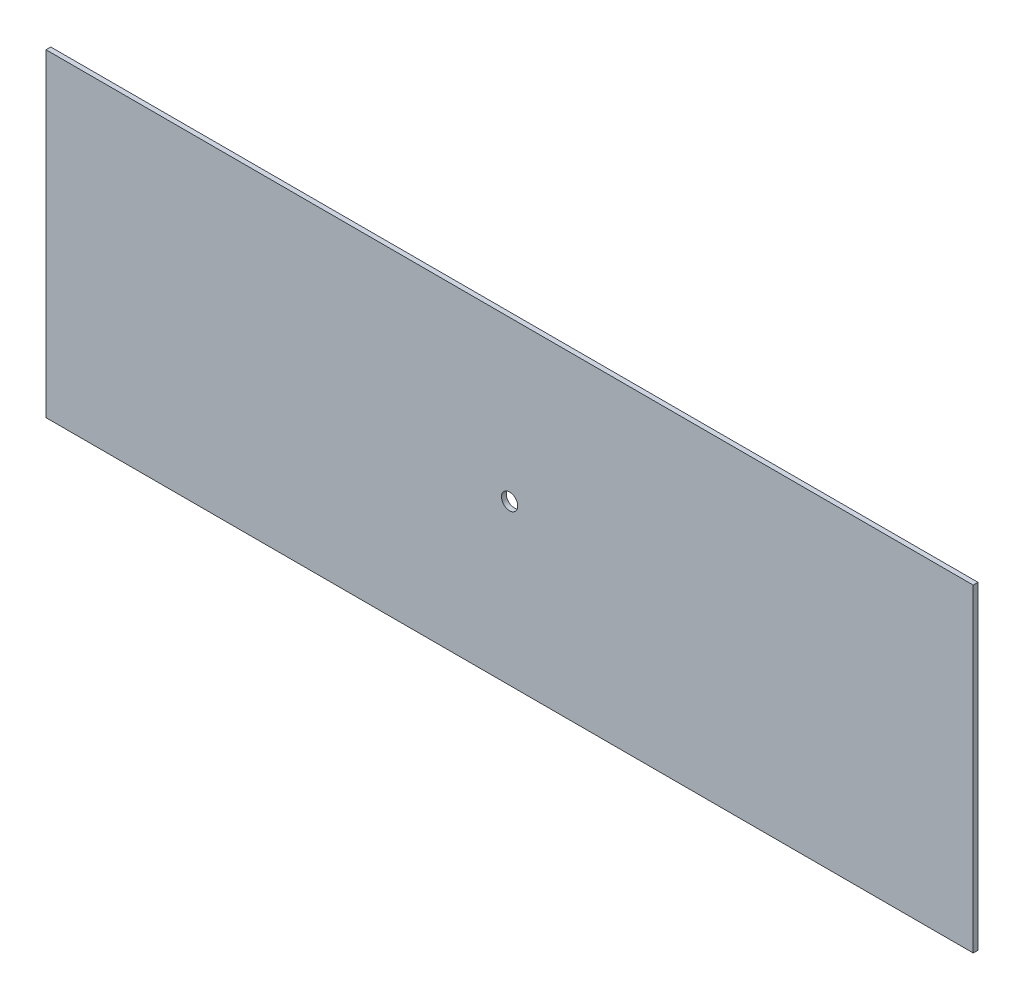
ISO-10303-21;
HEADER;
FILE_DESCRIPTION(('STEP AP214'),'2;1');
FILE_NAME('part.step','',(''),(''),'','','');
FILE_SCHEMA(('AUTOMOTIVE_DESIGN { 1 0 10303 214 1 1 1 1 }'));
ENDSEC;
DATA;
#1=APPLICATION_CONTEXT('core data for automotive mechanical design processes');
#2=APPLICATION_PROTOCOL_DEFINITION('international standard','automotive_design',2000,#1);
#3=PRODUCT_CONTEXT('',#1,'mechanical');
#4=PRODUCT('Part','Part','',(#3));
#5=PRODUCT_RELATED_PRODUCT_CATEGORY('part','',(#4));
#6=PRODUCT_DEFINITION_FORMATION('','',#4);
#7=PRODUCT_DEFINITION_CONTEXT('part definition',#1,'design');
#8=PRODUCT_DEFINITION('design','',#6,#7);
#9=PRODUCT_DEFINITION_SHAPE('','',#8);
#10=(LENGTH_UNIT() NAMED_UNIT(*) SI_UNIT(.MILLI.,.METRE.));
#11=(NAMED_UNIT(*) PLANE_ANGLE_UNIT() SI_UNIT($,.RADIAN.));
#12=(NAMED_UNIT(*) SI_UNIT($,.STERADIAN.) SOLID_ANGLE_UNIT());
#13=UNCERTAINTY_MEASURE_WITH_UNIT(LENGTH_MEASURE(1.E-05),#10,'distance_accuracy_value','');
#14=(GEOMETRIC_REPRESENTATION_CONTEXT(3) GLOBAL_UNCERTAINTY_ASSIGNED_CONTEXT((#13)) GLOBAL_UNIT_ASSIGNED_CONTEXT((#10,
#11,#12)) REPRESENTATION_CONTEXT('',''));
#15=CARTESIAN_POINT('',(0.,0.,0.));
#16=DIRECTION('',(0.,0.,1.));
#17=DIRECTION('',(1.,0.,0.));
#18=AXIS2_PLACEMENT_3D('',#15,#16,#17);
#19=CARTESIAN_POINT('',(457.2,-78.5622,-78.5622));
#20=DIRECTION('',(0.,1.,0.));
#21=DIRECTION('',(0.,0.,1.));
#22=AXIS2_PLACEMENT_3D('',#19,#20,#21);
#23=PLANE('',#22);
#24=DIRECTION('',(0.,0.,-1.));
#25=VECTOR('',#24,1.);
#26=CARTESIAN_POINT('',(0.,-78.5622,-78.5622));
#27=LINE('',#26,#25);
#28=CARTESIAN_POINT('',(0.,-78.5622,-76.2));
#29=VERTEX_POINT('',#28);
#30=CARTESIAN_POINT('',(0.,-78.5622,-78.5622));
#31=VERTEX_POINT('',#30);
#32=EDGE_CURVE('E116',#29,#31,#27,.T.);
#33=ORIENTED_EDGE('',*,*,#32,.T.);
#34=DIRECTION('',(-1.,0.,0.));
#35=VECTOR('',#34,1.);
#36=CARTESIAN_POINT('',(457.2,-78.5622,-78.5622));
#37=LINE('',#36,#35);
#38=CARTESIAN_POINT('',(457.2,-78.5622,-78.5622));
#39=VERTEX_POINT('',#38);
#40=EDGE_CURVE('E11',#39,#31,#37,.T.);
#41=ORIENTED_EDGE('',*,*,#40,.F.);
#42=DIRECTION('',(0.,0.,-1.));
#43=VECTOR('',#42,1.);
#44=CARTESIAN_POINT('',(457.2,-78.5622,-78.5622));
#45=LINE('',#44,#43);
#46=CARTESIAN_POINT('',(457.2,-78.5622,-76.2));
#47=VERTEX_POINT('',#46);
#48=EDGE_CURVE('E103',#47,#39,#45,.T.);
#49=ORIENTED_EDGE('',*,*,#48,.F.);
#50=DIRECTION('',(-1.,0.,0.));
#51=VECTOR('',#50,1.);
#52=CARTESIAN_POINT('',(457.2,-78.5622,-76.2));
#53=LINE('',#52,#51);
#54=EDGE_CURVE('E118',#47,#29,#53,.T.);
#55=ORIENTED_EDGE('',*,*,#54,.T.);
#56=EDGE_LOOP('',(#33,#41,#49,#55));
#57=FACE_BOUND('',#56,.T.);
#58=ADVANCED_FACE('F47',(#57),#23,.F.);
#59=CARTESIAN_POINT('',(457.2,-78.5622,-78.5622));
#60=DIRECTION('',(0.,0.,1.));
#61=DIRECTION('',(1.,0.,0.));
#62=AXIS2_PLACEMENT_3D('',#59,#60,#61);
#63=PLANE('',#62);
#64=CARTESIAN_POINT('',(228.6,0.,-78.5622));
#65=DIRECTION('',(0.,0.,1.));
#66=DIRECTION('',(1.,0.,0.));
#67=AXIS2_PLACEMENT_3D('',#64,#65,#66);
#68=CIRCLE('',#67,4.);
#69=CARTESIAN_POINT('',(232.6,0.,-78.5622));
#70=VERTEX_POINT('',#69);
#71=EDGE_CURVE('E138',#70,#70,#68,.T.);
#72=ORIENTED_EDGE('',*,*,#71,.T.);
#73=EDGE_LOOP('',(#72));
#74=FACE_BOUND('',#73,.T.);
#75=DIRECTION('',(0.,1.,0.));
#76=VECTOR('',#75,1.);
#77=CARTESIAN_POINT('',(0.,-78.5622,-78.5622));
#78=LINE('',#77,#76);
#79=CARTESIAN_POINT('',(0.,78.5622,-78.5622));
#80=VERTEX_POINT('',#79);
#81=EDGE_CURVE('E107',#31,#80,#78,.T.);
#82=ORIENTED_EDGE('',*,*,#81,.T.);
#83=DIRECTION('',(-1.,0.,0.));
#84=VECTOR('',#83,1.);
#85=CARTESIAN_POINT('',(457.2,78.5622,-78.5622));
#86=LINE('',#85,#84);
#87=CARTESIAN_POINT('',(457.2,78.5622,-78.5622));
#88=VERTEX_POINT('',#87);
#89=EDGE_CURVE('E58',#88,#80,#86,.T.);
#90=ORIENTED_EDGE('',*,*,#89,.F.);
#91=DIRECTION('',(0.,1.,0.));
#92=VECTOR('',#91,1.);
#93=CARTESIAN_POINT('',(457.2,-78.5622,-78.5622));
#94=LINE('',#93,#92);
#95=EDGE_CURVE('E98',#39,#88,#94,.T.);
#96=ORIENTED_EDGE('',*,*,#95,.F.);
#97=ORIENTED_EDGE('',*,*,#40,.T.);
#98=EDGE_LOOP('',(#82,#90,#96,#97));
#99=FACE_BOUND('',#98,.T.);
#100=ADVANCED_FACE('F110',(#74,#99),#63,.F.);
#101=CARTESIAN_POINT('',(457.2,78.5622,-78.5622));
#102=DIRECTION('',(0.,-1.,0.));
#103=DIRECTION('',(0.,0.,-1.));
#104=AXIS2_PLACEMENT_3D('',#101,#102,#103);
#105=PLANE('',#104);
#106=DIRECTION('',(0.,0.,1.));
#107=VECTOR('',#106,1.);
#108=CARTESIAN_POINT('',(0.,78.5622,-78.5622));
#109=LINE('',#108,#107);
#110=CARTESIAN_POINT('',(0.,78.5622,-76.2));
#111=VERTEX_POINT('',#110);
#112=EDGE_CURVE('E83',#80,#111,#109,.T.);
#113=ORIENTED_EDGE('',*,*,#112,.T.);
#114=DIRECTION('',(-1.,0.,0.));
#115=VECTOR('',#114,1.);
#116=CARTESIAN_POINT('',(457.2,78.5622,-76.2));
#117=LINE('',#116,#115);
#118=CARTESIAN_POINT('',(457.2,78.5622,-76.2));
#119=VERTEX_POINT('',#118);
#120=EDGE_CURVE('E109',#119,#111,#117,.T.);
#121=ORIENTED_EDGE('',*,*,#120,.F.);
#122=DIRECTION('',(0.,0.,1.));
#123=VECTOR('',#122,1.);
#124=CARTESIAN_POINT('',(457.2,78.5622,-78.5622));
#125=LINE('',#124,#123);
#126=EDGE_CURVE('E101',#88,#119,#125,.T.);
#127=ORIENTED_EDGE('',*,*,#126,.F.);
#128=ORIENTED_EDGE('',*,*,#89,.T.);
#129=EDGE_LOOP('',(#113,#121,#127,#128));
#130=FACE_BOUND('',#129,.T.);
#131=ADVANCED_FACE('F115',(#130),#105,.F.);
#132=CARTESIAN_POINT('',(457.2,-78.5622,-76.2));
#133=DIRECTION('',(0.,0.,-1.));
#134=DIRECTION('',(-1.,0.,0.));
#135=AXIS2_PLACEMENT_3D('',#132,#133,#134);
#136=PLANE('',#135);
#137=CARTESIAN_POINT('',(228.6,0.,-76.2));
#138=DIRECTION('',(0.,0.,-1.));
#139=DIRECTION('',(-1.,0.,0.));
#140=AXIS2_PLACEMENT_3D('',#137,#138,#139);
#141=CIRCLE('',#140,4.);
#142=CARTESIAN_POINT('',(224.6,0.,-76.2));
#143=VERTEX_POINT('',#142);
#144=EDGE_CURVE('E52',#143,#143,#141,.T.);
#145=ORIENTED_EDGE('',*,*,#144,.T.);
#146=EDGE_LOOP('',(#145));
#147=FACE_BOUND('',#146,.T.);
#148=DIRECTION('',(0.,-1.,0.));
#149=VECTOR('',#148,1.);
#150=CARTESIAN_POINT('',(0.,-78.5622,-76.2));
#151=LINE('',#150,#149);
#152=EDGE_CURVE('E93',#111,#29,#151,.T.);
#153=ORIENTED_EDGE('',*,*,#152,.T.);
#154=ORIENTED_EDGE('',*,*,#54,.F.);
#155=DIRECTION('',(0.,-1.,0.));
#156=VECTOR('',#155,1.);
#157=CARTESIAN_POINT('',(457.2,-78.5622,-76.2));
#158=LINE('',#157,#156);
#159=EDGE_CURVE('E70',#119,#47,#158,.T.);
#160=ORIENTED_EDGE('',*,*,#159,.F.);
#161=ORIENTED_EDGE('',*,*,#120,.T.);
#162=EDGE_LOOP('',(#153,#154,#160,#161));
#163=FACE_BOUND('',#162,.T.);
#164=ADVANCED_FACE('F132',(#147,#163),#136,.F.);
#165=CARTESIAN_POINT('',(457.2,0.,0.));
#166=DIRECTION('',(-1.,0.,0.));
#167=DIRECTION('',(0.,0.,1.));
#168=AXIS2_PLACEMENT_3D('',#165,#166,#167);
#169=PLANE('',#168);
#170=ORIENTED_EDGE('',*,*,#48,.T.);
#171=ORIENTED_EDGE('',*,*,#95,.T.);
#172=ORIENTED_EDGE('',*,*,#126,.T.);
#173=ORIENTED_EDGE('',*,*,#159,.T.);
#174=EDGE_LOOP('',(#170,#171,#172,#173));
#175=FACE_BOUND('',#174,.T.);
#176=ADVANCED_FACE('F97',(#175),#169,.F.);
#177=CARTESIAN_POINT('',(0.,0.,0.));
#178=DIRECTION('',(-1.,0.,0.));
#179=DIRECTION('',(0.,0.,1.));
#180=AXIS2_PLACEMENT_3D('',#177,#178,#179);
#181=PLANE('',#180);
#182=ORIENTED_EDGE('',*,*,#32,.F.);
#183=ORIENTED_EDGE('',*,*,#152,.F.);
#184=ORIENTED_EDGE('',*,*,#112,.F.);
#185=ORIENTED_EDGE('',*,*,#81,.F.);
#186=EDGE_LOOP('',(#182,#183,#184,#185));
#187=FACE_BOUND('',#186,.T.);
#188=ADVANCED_FACE('F137',(#187),#181,.T.);
#189=CARTESIAN_POINT('',(228.6,0.,-78.5622));
#190=DIRECTION('',(0.,0.,1.));
#191=DIRECTION('',(1.,0.,0.));
#192=AXIS2_PLACEMENT_3D('',#189,#190,#191);
#193=CYLINDRICAL_SURFACE('',#192,4.);
#194=ORIENTED_EDGE('',*,*,#71,.F.);
#195=EDGE_LOOP('',(#194));
#196=FACE_BOUND('',#195,.T.);
#197=ORIENTED_EDGE('',*,*,#144,.F.);
#198=EDGE_LOOP('',(#197));
#199=FACE_BOUND('',#198,.T.);
#200=ADVANCED_FACE('F147',(#196,#199),#193,.F.);
#201=CLOSED_SHELL('',(#58,#100,#131,#164,#176,#188,#200));
#202=MANIFOLD_SOLID_BREP('B2',#201);
#203=ADVANCED_BREP_SHAPE_REPRESENTATION('',(#18,#202),#14);
#204=SHAPE_DEFINITION_REPRESENTATION(#9,#203);
ENDSEC;
END-ISO-10303-21;
